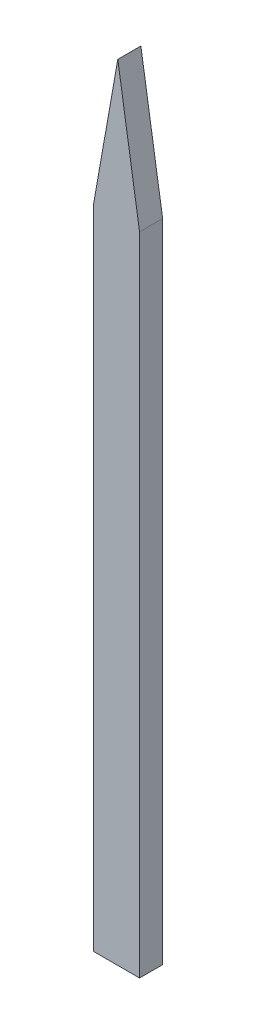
from build123d import *

# Parameters (mm, degrees)
EXTRUSION1_DEPTH = 0.5


with BuildPart() as part:
    # Esquisse1 → Extrusion1 (new body)
    with BuildSketch(Plane.XY):
        Polygon((0, 0), (0, 14), (0.528980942, 17), (1, 14), (1, 0), align=None)
    extrude(amount=EXTRUSION1_DEPTH)


solid = part.part
